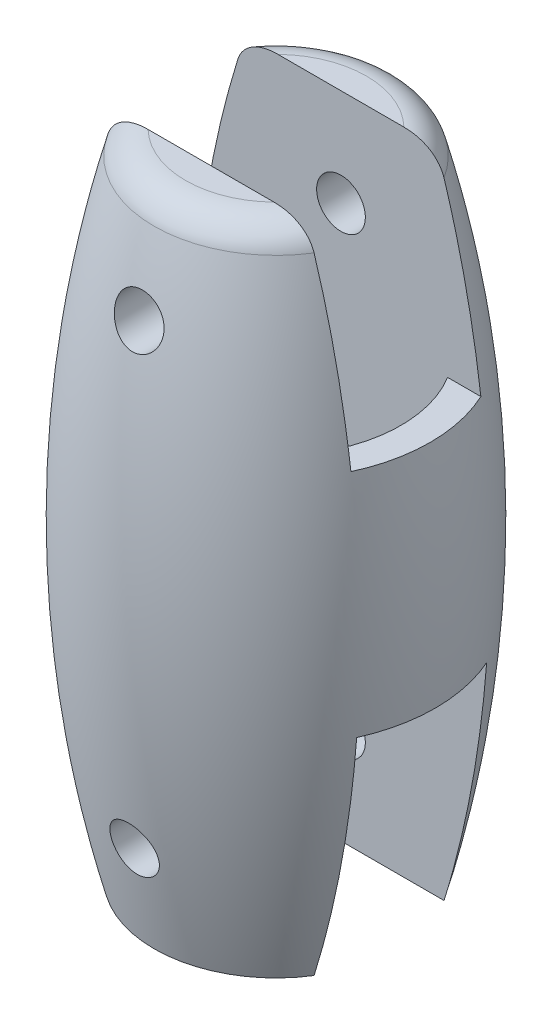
from build123d import *

# Parameters (mm, degrees)
SKETCH1_W               = 4
SKETCH1_H               = 12
CUT_EXTRUDE1_DEPTH      = 25.497846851
CUT_EXTRUDE1_DEPTH_BACK = 25.497846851
SKETCH1_6_W             = 4
SKETCH1_6_H             = 12
CUT_EXTRUDE2_DEPTH      = 25.497846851
CUT_EXTRUDE2_DEPTH_BACK = 25.497846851
SKETCH3_R               = 1.5
CUT_EXTRUDE3_DEPTH      = 25.497846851
CUT_EXTRUDE3_DEPTH_BACK = 25.497846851


with BuildPart() as part:
    # Sketch1 → Revolve7 (revolve)
    with BuildSketch(Plane(origin=(0, 0, 0), x_dir=(0, 0, -1), z_dir=(1, 0, 0)), mode=Mode.PRIVATE) as revolve7_sk:
        with BuildLine():
            Line((4, 8), (0, 8))
            Line((0, 8), (0, -6))
            Line((0, -6), (4, -6))
            Line((4, -6), (4, -8))
            Line((4, -8), (4, -20))
            Line((4, -20), (7.5, -20))
            ThreePointArc((7.5, -20), (10.003611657, -0.737750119), (7.5, 18.524499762))
            ThreePointArc((7.5, 18.524499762), (6.784701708, 19.588867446), (5.57, 20))
            Line((5.57, 20), (4, 20))
            Line((4, 20), (4, 8))
        make_face()
        with Locations((2, 14)):
            Rectangle(SKETCH1_W, SKETCH1_H)
        Polygon((4, -6), (0, -6), (0, -13.5), (0, -20), (4, -20), (4, -8), align=None)
    revolve(revolve7_sk.sketch.rotate(Axis((0, 20, 0), (0, -1, 0)), 180), axis=Axis((0, 20, 0), (0, -1, 0)))

    # Sketch1_6 → Cut-Extrude1 (cut, two sides: drawn at the far end of the back side and taken through both)
    with BuildSketch(Plane(origin=(0, 0, 0), x_dir=(0, 0, -1), z_dir=(1, 0, 0)).offset(-CUT_EXTRUDE1_DEPTH_BACK)):
        with Locations((-2, 14)):
            Rectangle(SKETCH1_6_W, SKETCH1_6_H)
        with Locations((2, 14)):
            Rectangle(SKETCH1_6_W, SKETCH1_6_H)
        Polygon((4, -6), (0, -6), (0, -13.5), (0, -20), (4, -20), (4, -8), align=None)
        Polygon((-4, -8), (-4, -20), (0, -20), (0, -13.5), (0, -6), (-4, -6), align=None)
    extrude(amount=CUT_EXTRUDE1_DEPTH + CUT_EXTRUDE1_DEPTH_BACK, mode=Mode.SUBTRACT)

    # Sketch3 → Cut-Extrude2 (cut, two sides: drawn at the far end of the back side and taken through both)
    with BuildSketch(Plane.XY.offset(-CUT_EXTRUDE2_DEPTH_BACK)):
        with Locations(Location((0, 14, 0), (0, 0, 90))):
            Circle(SKETCH3_R)
        with Locations(Location((0, -14, 0), (0, 0, 226.087454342))):
            Circle(SKETCH3_R)
        with BuildLine():
            Line((8.092562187, -21.092428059), (7.095313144, -20))
            Line((7.095313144, -20), (3.160642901, -20))
            ThreePointArc((3.160642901, -20), (5.564611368, -20.826081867), (8.092562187, -21.092428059))
        make_face()
    extrude(amount=CUT_EXTRUDE2_DEPTH + CUT_EXTRUDE2_DEPTH_BACK, mode=Mode.SUBTRACT)

    # Sketch4 → Cut-Extrude3 (cut, two sides: drawn at the far end of the back side and taken through both)
    with BuildSketch(Plane(origin=(0, 0, 0), x_dir=(1, 0, 0), z_dir=(0, 1, 0)).offset(-CUT_EXTRUDE3_DEPTH_BACK)):
        with BuildLine():
            Line((-6.56770373, -4), (6.56770373, -4))
            ThreePointArc((6.56770373, -4), (7.689911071, 0), (6.56770373, 4))
            Line((6.56770373, 4), (-6.56770373, 4))
            ThreePointArc((-6.56770373, 4), (-7.689911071, 0), (-6.56770373, -4))
        make_face()
    extrude(amount=CUT_EXTRUDE3_DEPTH + CUT_EXTRUDE3_DEPTH_BACK, mode=Mode.SUBTRACT)


solid = part.part
